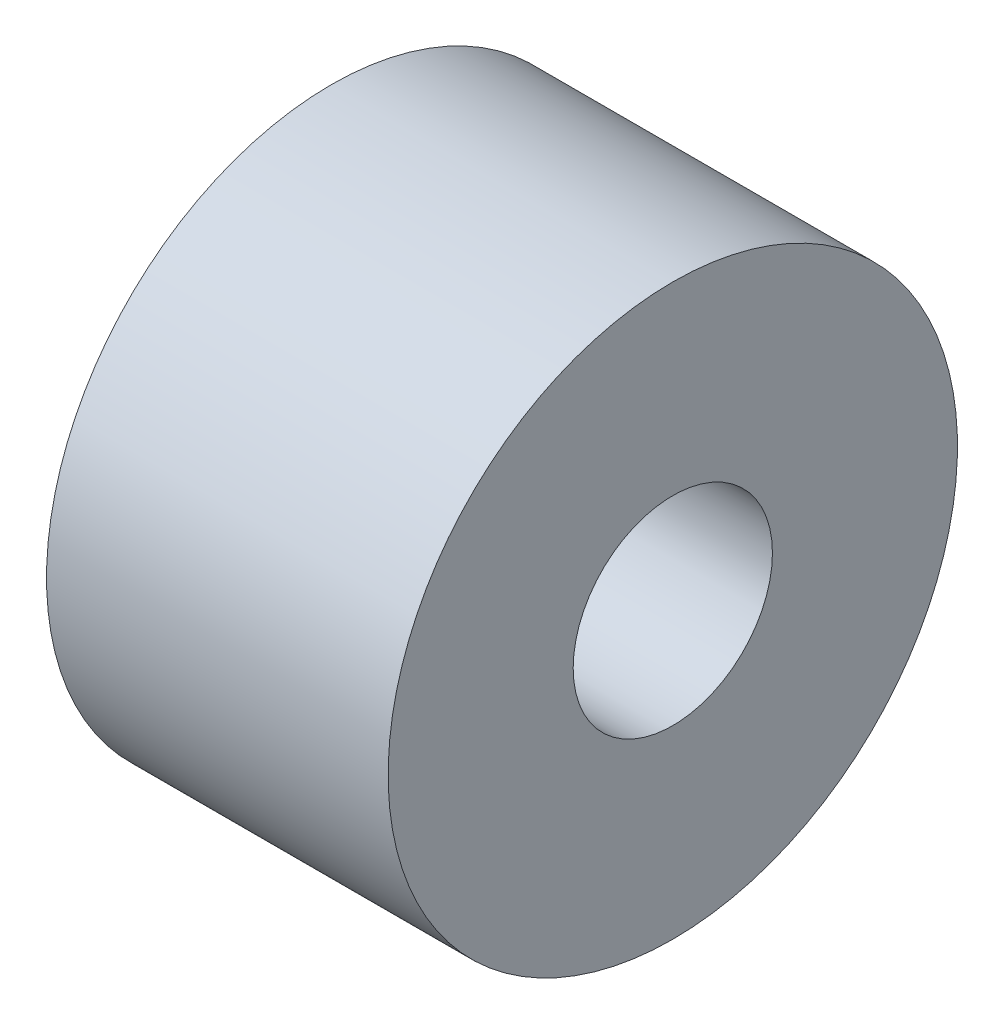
ISO-10303-21;
HEADER;
FILE_DESCRIPTION(('STEP AP214'),'2;1');
FILE_NAME('part.step','',(''),(''),'','','');
FILE_SCHEMA(('AUTOMOTIVE_DESIGN { 1 0 10303 214 1 1 1 1 }'));
ENDSEC;
DATA;
#1=APPLICATION_CONTEXT('core data for automotive mechanical design processes');
#2=APPLICATION_PROTOCOL_DEFINITION('international standard','automotive_design',2000,#1);
#3=PRODUCT_CONTEXT('',#1,'mechanical');
#4=PRODUCT('Part','Part','',(#3));
#5=PRODUCT_RELATED_PRODUCT_CATEGORY('part','',(#4));
#6=PRODUCT_DEFINITION_FORMATION('','',#4);
#7=PRODUCT_DEFINITION_CONTEXT('part definition',#1,'design');
#8=PRODUCT_DEFINITION('design','',#6,#7);
#9=PRODUCT_DEFINITION_SHAPE('','',#8);
#10=(LENGTH_UNIT() NAMED_UNIT(*) SI_UNIT(.MILLI.,.METRE.));
#11=(NAMED_UNIT(*) PLANE_ANGLE_UNIT() SI_UNIT($,.RADIAN.));
#12=(NAMED_UNIT(*) SI_UNIT($,.STERADIAN.) SOLID_ANGLE_UNIT());
#13=UNCERTAINTY_MEASURE_WITH_UNIT(LENGTH_MEASURE(1.E-05),#10,'distance_accuracy_value','');
#14=(GEOMETRIC_REPRESENTATION_CONTEXT(3) GLOBAL_UNCERTAINTY_ASSIGNED_CONTEXT((#13)) GLOBAL_UNIT_ASSIGNED_CONTEXT((#10,
#11,#12)) REPRESENTATION_CONTEXT('',''));
#15=CARTESIAN_POINT('',(0.,0.,0.));
#16=DIRECTION('',(0.,0.,1.));
#17=DIRECTION('',(1.,0.,0.));
#18=AXIS2_PLACEMENT_3D('',#15,#16,#17);
#19=CARTESIAN_POINT('',(0.,0.,0.));
#20=DIRECTION('',(1.,0.,0.));
#21=DIRECTION('',(0.,1.,0.));
#22=AXIS2_PLACEMENT_3D('',#19,#20,#21);
#23=PLANE('',#22);
#24=CARTESIAN_POINT('',(0.,0.,0.));
#25=DIRECTION('',(-1.,0.,0.));
#26=DIRECTION('',(0.,0.,1.));
#27=AXIS2_PLACEMENT_3D('',#24,#25,#26);
#28=CIRCLE('',#27,1.74999999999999);
#29=CARTESIAN_POINT('',(0.,0.,1.74999999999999));
#30=VERTEX_POINT('',#29);
#31=EDGE_CURVE('E39',#30,#30,#28,.T.);
#32=ORIENTED_EDGE('',*,*,#31,.T.);
#33=EDGE_LOOP('',(#32));
#34=FACE_BOUND('',#33,.T.);
#35=CARTESIAN_POINT('',(0.,0.,0.));
#36=DIRECTION('',(1.,0.,0.));
#37=DIRECTION('',(0.,1.,0.));
#38=AXIS2_PLACEMENT_3D('',#35,#36,#37);
#39=CIRCLE('',#38,5.);
#40=CARTESIAN_POINT('',(0.,5.,0.));
#41=VERTEX_POINT('',#40);
#42=EDGE_CURVE('E10',#41,#41,#39,.T.);
#43=ORIENTED_EDGE('',*,*,#42,.T.);
#44=EDGE_LOOP('',(#43));
#45=FACE_BOUND('',#44,.T.);
#46=ADVANCED_FACE('F29',(#34,#45),#23,.T.);
#47=CARTESIAN_POINT('',(0.,0.,0.));
#48=DIRECTION('',(1.,0.,0.));
#49=DIRECTION('',(0.,1.,0.));
#50=AXIS2_PLACEMENT_3D('',#47,#48,#49);
#51=CYLINDRICAL_SURFACE('',#50,5.);
#52=CARTESIAN_POINT('',(-6.,0.,0.));
#53=DIRECTION('',(1.,0.,0.));
#54=DIRECTION('',(0.,1.,0.));
#55=AXIS2_PLACEMENT_3D('',#52,#53,#54);
#56=CIRCLE('',#55,5.);
#57=CARTESIAN_POINT('',(-6.,5.,0.));
#58=VERTEX_POINT('',#57);
#59=EDGE_CURVE('E35',#58,#58,#56,.T.);
#60=ORIENTED_EDGE('',*,*,#59,.T.);
#61=EDGE_LOOP('',(#60));
#62=FACE_BOUND('',#61,.T.);
#63=ORIENTED_EDGE('',*,*,#42,.F.);
#64=EDGE_LOOP('',(#63));
#65=FACE_BOUND('',#64,.T.);
#66=ADVANCED_FACE('F58',(#62,#65),#51,.T.);
#67=CARTESIAN_POINT('',(-6.,0.,0.));
#68=DIRECTION('',(-1.,0.,0.));
#69=DIRECTION('',(0.,-1.,0.));
#70=AXIS2_PLACEMENT_3D('',#67,#68,#69);
#71=PLANE('',#70);
#72=CARTESIAN_POINT('',(-6.,0.,0.));
#73=DIRECTION('',(-1.,0.,0.));
#74=DIRECTION('',(0.,0.,1.));
#75=AXIS2_PLACEMENT_3D('',#72,#73,#74);
#76=CIRCLE('',#75,3.15);
#77=CARTESIAN_POINT('',(-6.,0.,3.15));
#78=VERTEX_POINT('',#77);
#79=EDGE_CURVE('E48',#78,#78,#76,.T.);
#80=ORIENTED_EDGE('',*,*,#79,.F.);
#81=EDGE_LOOP('',(#80));
#82=FACE_BOUND('',#81,.T.);
#83=ORIENTED_EDGE('',*,*,#59,.F.);
#84=EDGE_LOOP('',(#83));
#85=FACE_BOUND('',#84,.T.);
#86=ADVANCED_FACE('F54',(#82,#85),#71,.T.);
#87=CARTESIAN_POINT('',(-6.,0.,0.));
#88=DIRECTION('',(-1.,0.,0.));
#89=DIRECTION('',(0.,0.,1.));
#90=AXIS2_PLACEMENT_3D('',#87,#88,#89);
#91=CYLINDRICAL_SURFACE('',#90,1.74999999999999);
#92=ORIENTED_EDGE('',*,*,#31,.F.);
#93=EDGE_LOOP('',(#92));
#94=FACE_BOUND('',#93,.T.);
#95=CARTESIAN_POINT('',(-4.6,0.,0.));
#96=DIRECTION('',(-1.,0.,0.));
#97=DIRECTION('',(0.,0.,1.));
#98=AXIS2_PLACEMENT_3D('',#95,#96,#97);
#99=CIRCLE('',#98,1.75);
#100=CARTESIAN_POINT('',(-4.6,0.,1.75));
#101=VERTEX_POINT('',#100);
#102=EDGE_CURVE('E43',#101,#101,#99,.T.);
#103=ORIENTED_EDGE('',*,*,#102,.T.);
#104=EDGE_LOOP('',(#103));
#105=FACE_BOUND('',#104,.T.);
#106=ADVANCED_FACE('F57',(#94,#105),#91,.F.);
#107=CARTESIAN_POINT('',(-6.,0.,0.));
#108=DIRECTION('',(-1.,0.,0.));
#109=DIRECTION('',(0.,0.,1.));
#110=AXIS2_PLACEMENT_3D('',#107,#108,#109);
#111=CONICAL_SURFACE('',#110,3.15,0.785398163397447);
#112=ORIENTED_EDGE('',*,*,#102,.F.);
#113=EDGE_LOOP('',(#112));
#114=FACE_BOUND('',#113,.T.);
#115=ORIENTED_EDGE('',*,*,#79,.T.);
#116=EDGE_LOOP('',(#115));
#117=FACE_BOUND('',#116,.T.);
#118=ADVANCED_FACE('F52',(#114,#117),#111,.F.);
#119=CLOSED_SHELL('',(#46,#66,#86,#106,#118));
#120=MANIFOLD_SOLID_BREP('B2',#119);
#121=ADVANCED_BREP_SHAPE_REPRESENTATION('',(#18,#120),#14);
#122=SHAPE_DEFINITION_REPRESENTATION(#9,#121);
ENDSEC;
END-ISO-10303-21;
